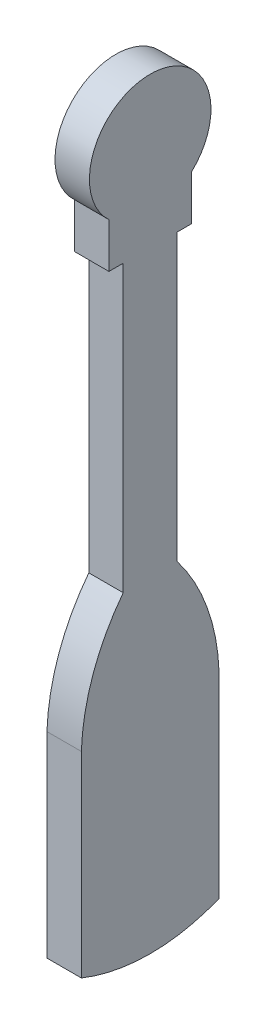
ISO-10303-21;
HEADER;
FILE_DESCRIPTION(('STEP AP214'),'2;1');
FILE_NAME('part.step','',(''),(''),'','','');
FILE_SCHEMA(('AUTOMOTIVE_DESIGN { 1 0 10303 214 1 1 1 1 }'));
ENDSEC;
DATA;
#1=APPLICATION_CONTEXT('core data for automotive mechanical design processes');
#2=APPLICATION_PROTOCOL_DEFINITION('international standard','automotive_design',2000,#1);
#3=PRODUCT_CONTEXT('',#1,'mechanical');
#4=PRODUCT('Part','Part','',(#3));
#5=PRODUCT_RELATED_PRODUCT_CATEGORY('part','',(#4));
#6=PRODUCT_DEFINITION_FORMATION('','',#4);
#7=PRODUCT_DEFINITION_CONTEXT('part definition',#1,'design');
#8=PRODUCT_DEFINITION('design','',#6,#7);
#9=PRODUCT_DEFINITION_SHAPE('','',#8);
#10=(LENGTH_UNIT() NAMED_UNIT(*) SI_UNIT(.MILLI.,.METRE.));
#11=(NAMED_UNIT(*) PLANE_ANGLE_UNIT() SI_UNIT($,.RADIAN.));
#12=(NAMED_UNIT(*) SI_UNIT($,.STERADIAN.) SOLID_ANGLE_UNIT());
#13=UNCERTAINTY_MEASURE_WITH_UNIT(LENGTH_MEASURE(1.E-05),#10,'distance_accuracy_value','');
#14=(GEOMETRIC_REPRESENTATION_CONTEXT(3) GLOBAL_UNCERTAINTY_ASSIGNED_CONTEXT((#13)) GLOBAL_UNIT_ASSIGNED_CONTEXT((#10,
#11,#12)) REPRESENTATION_CONTEXT('',''));
#15=CARTESIAN_POINT('',(0.,0.,0.));
#16=DIRECTION('',(0.,0.,1.));
#17=DIRECTION('',(1.,0.,0.));
#18=AXIS2_PLACEMENT_3D('',#15,#16,#17);
#19=CARTESIAN_POINT('',(15.,4855.89846396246,-12806.2490065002));
#20=DIRECTION('',(-1.,0.,0.));
#21=DIRECTION('',(0.,0.,1.));
#22=AXIS2_PLACEMENT_3D('',#19,#20,#21);
#23=CYLINDRICAL_SURFACE('',#22,26.479842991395);
#24=CARTESIAN_POINT('',(0.,4855.89846396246,-12806.2490065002));
#25=DIRECTION('',(1.,0.,0.));
#26=DIRECTION('',(0.,0.,-1.));
#27=AXIS2_PLACEMENT_3D('',#24,#25,#26);
#28=CIRCLE('',#27,26.479842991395);
#29=CARTESIAN_POINT('',(0.,4836.46374072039,-12824.2343788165));
#30=VERTEX_POINT('',#29);
#31=CARTESIAN_POINT('',(0.,4836.46374072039,-12788.263634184));
#32=VERTEX_POINT('',#31);
#33=EDGE_CURVE('E155',#30,#32,#28,.T.);
#34=ORIENTED_EDGE('',*,*,#33,.T.);
#35=DIRECTION('',(-1.,0.,0.));
#36=VECTOR('',#35,1.);
#37=CARTESIAN_POINT('',(15.,4836.46374072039,-12788.263634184));
#38=LINE('',#37,#36);
#39=CARTESIAN_POINT('',(15.,4836.46374072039,-12788.263634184));
#40=VERTEX_POINT('',#39);
#41=EDGE_CURVE('E11',#40,#32,#38,.T.);
#42=ORIENTED_EDGE('',*,*,#41,.F.);
#43=CARTESIAN_POINT('',(15.,4855.89846396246,-12806.2490065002));
#44=DIRECTION('',(1.,0.,0.));
#45=DIRECTION('',(0.,0.,-1.));
#46=AXIS2_PLACEMENT_3D('',#43,#44,#45);
#47=CIRCLE('',#46,26.479842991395);
#48=CARTESIAN_POINT('',(15.,4836.46374072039,-12824.2343788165));
#49=VERTEX_POINT('',#48);
#50=EDGE_CURVE('E177',#49,#40,#47,.T.);
#51=ORIENTED_EDGE('',*,*,#50,.F.);
#52=DIRECTION('',(-1.,0.,0.));
#53=VECTOR('',#52,1.);
#54=CARTESIAN_POINT('',(15.,4836.46374072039,-12824.2343788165));
#55=LINE('',#54,#53);
#56=EDGE_CURVE('E151',#49,#30,#55,.T.);
#57=ORIENTED_EDGE('',*,*,#56,.T.);
#58=EDGE_LOOP('',(#34,#42,#51,#57));
#59=FACE_BOUND('',#58,.T.);
#60=ADVANCED_FACE('F35',(#59),#23,.T.);
#61=CARTESIAN_POINT('',(15.,4836.46374072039,-12788.263634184));
#62=DIRECTION('',(0.,-2.72355001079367E-13,-1.));
#63=DIRECTION('',(0.,1.,-2.72355001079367E-13));
#64=AXIS2_PLACEMENT_3D('',#61,#62,#63);
#65=PLANE('',#64);
#66=DIRECTION('',(0.,-1.,2.72355001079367E-13));
#67=VECTOR('',#66,1.);
#68=CARTESIAN_POINT('',(0.,4836.46374072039,-12788.263634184));
#69=LINE('',#68,#67);
#70=CARTESIAN_POINT('',(0.,4816.89710710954,-12788.263634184));
#71=VERTEX_POINT('',#70);
#72=EDGE_CURVE('E158',#32,#71,#69,.T.);
#73=ORIENTED_EDGE('',*,*,#72,.T.);
#74=DIRECTION('',(-1.,0.,0.));
#75=VECTOR('',#74,1.);
#76=CARTESIAN_POINT('',(15.,4816.89710710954,-12788.263634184));
#77=LINE('',#76,#75);
#78=CARTESIAN_POINT('',(15.,4816.89710710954,-12788.263634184));
#79=VERTEX_POINT('',#78);
#80=EDGE_CURVE('E43',#79,#71,#77,.T.);
#81=ORIENTED_EDGE('',*,*,#80,.F.);
#82=DIRECTION('',(0.,-1.,2.72355001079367E-13));
#83=VECTOR('',#82,1.);
#84=CARTESIAN_POINT('',(15.,4836.46374072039,-12788.263634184));
#85=LINE('',#84,#83);
#86=EDGE_CURVE('E106',#40,#79,#85,.T.);
#87=ORIENTED_EDGE('',*,*,#86,.F.);
#88=ORIENTED_EDGE('',*,*,#41,.T.);
#89=EDGE_LOOP('',(#73,#81,#87,#88));
#90=FACE_BOUND('',#89,.T.);
#91=ADVANCED_FACE('F255',(#90),#65,.F.);
#92=CARTESIAN_POINT('',(15.,4816.89710710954,-12788.263634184));
#93=DIRECTION('',(0.,1.,0.));
#94=DIRECTION('',(0.,0.,1.));
#95=AXIS2_PLACEMENT_3D('',#92,#93,#94);
#96=PLANE('',#95);
#97=DIRECTION('',(0.,0.,-1.));
#98=VECTOR('',#97,1.);
#99=CARTESIAN_POINT('',(0.,4816.89710710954,-12788.263634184));
#100=LINE('',#99,#98);
#101=CARTESIAN_POINT('',(0.,4816.89710710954,-12794.4817255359));
#102=VERTEX_POINT('',#101);
#103=EDGE_CURVE('E160',#71,#102,#100,.T.);
#104=ORIENTED_EDGE('',*,*,#103,.T.);
#105=DIRECTION('',(-1.,0.,0.));
#106=VECTOR('',#105,1.);
#107=CARTESIAN_POINT('',(15.,4816.89710710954,-12794.4817255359));
#108=LINE('',#107,#106);
#109=CARTESIAN_POINT('',(15.,4816.89710710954,-12794.4817255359));
#110=VERTEX_POINT('',#109);
#111=EDGE_CURVE('E196',#110,#102,#108,.T.);
#112=ORIENTED_EDGE('',*,*,#111,.F.);
#113=DIRECTION('',(0.,0.,-1.));
#114=VECTOR('',#113,1.);
#115=CARTESIAN_POINT('',(15.,4816.89710710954,-12788.263634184));
#116=LINE('',#115,#114);
#117=EDGE_CURVE('E204',#79,#110,#116,.T.);
#118=ORIENTED_EDGE('',*,*,#117,.F.);
#119=ORIENTED_EDGE('',*,*,#80,.T.);
#120=EDGE_LOOP('',(#104,#112,#118,#119));
#121=FACE_BOUND('',#120,.T.);
#122=ADVANCED_FACE('F202',(#121),#96,.F.);
#123=CARTESIAN_POINT('',(15.,4816.89710710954,-12794.4817255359));
#124=DIRECTION('',(0.,0.,-1.));
#125=DIRECTION('',(-1.,0.,0.));
#126=AXIS2_PLACEMENT_3D('',#123,#124,#125);
#127=PLANE('',#126);
#128=DIRECTION('',(0.,-1.,0.));
#129=VECTOR('',#128,1.);
#130=CARTESIAN_POINT('',(0.,4816.89710710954,-12794.4817255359));
#131=LINE('',#130,#129);
#132=CARTESIAN_POINT('',(0.,4692.5329775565,-12794.4817255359));
#133=VERTEX_POINT('',#132);
#134=EDGE_CURVE('E162',#102,#133,#131,.T.);
#135=ORIENTED_EDGE('',*,*,#134,.T.);
#136=DIRECTION('',(-1.,0.,0.));
#137=VECTOR('',#136,1.);
#138=CARTESIAN_POINT('',(15.,4692.5329775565,-12794.4817255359));
#139=LINE('',#138,#137);
#140=CARTESIAN_POINT('',(15.,4692.5329775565,-12794.4817255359));
#141=VERTEX_POINT('',#140);
#142=EDGE_CURVE('E193',#141,#133,#139,.T.);
#143=ORIENTED_EDGE('',*,*,#142,.F.);
#144=DIRECTION('',(0.,-1.,0.));
#145=VECTOR('',#144,1.);
#146=CARTESIAN_POINT('',(15.,4816.89710710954,-12794.4817255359));
#147=LINE('',#146,#145);
#148=EDGE_CURVE('E222',#110,#141,#147,.T.);
#149=ORIENTED_EDGE('',*,*,#148,.F.);
#150=ORIENTED_EDGE('',*,*,#111,.T.);
#151=EDGE_LOOP('',(#135,#143,#149,#150));
#152=FACE_BOUND('',#151,.T.);
#153=ADVANCED_FACE('F213',(#152),#127,.F.);
#154=CARTESIAN_POINT('',(15.,4638.68592470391,-12864.6206511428));
#155=DIRECTION('',(-1.,0.,0.));
#156=DIRECTION('',(0.,0.,1.));
#157=AXIS2_PLACEMENT_3D('',#154,#155,#156);
#158=CYLINDRICAL_SURFACE('',#157,88.4249624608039);
#159=CARTESIAN_POINT('',(0.,4638.68592470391,-12864.6206511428));
#160=DIRECTION('',(1.,0.,0.));
#161=DIRECTION('',(0.,0.,-1.));
#162=AXIS2_PLACEMENT_3D('',#159,#160,#161);
#163=CIRCLE('',#162,88.4249624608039);
#164=CARTESIAN_POINT('',(0.,4641.75617051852,-12776.2490065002));
#165=VERTEX_POINT('',#164);
#166=EDGE_CURVE('E164',#133,#165,#163,.T.);
#167=ORIENTED_EDGE('',*,*,#166,.T.);
#168=DIRECTION('',(-1.,0.,0.));
#169=VECTOR('',#168,1.);
#170=CARTESIAN_POINT('',(15.,4641.75617051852,-12776.2490065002));
#171=LINE('',#170,#169);
#172=CARTESIAN_POINT('',(15.,4641.75617051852,-12776.2490065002));
#173=VERTEX_POINT('',#172);
#174=EDGE_CURVE('E190',#173,#165,#171,.T.);
#175=ORIENTED_EDGE('',*,*,#174,.F.);
#176=CARTESIAN_POINT('',(15.,4638.68592470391,-12864.6206511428));
#177=DIRECTION('',(1.,0.,0.));
#178=DIRECTION('',(0.,0.,-1.));
#179=AXIS2_PLACEMENT_3D('',#176,#177,#178);
#180=CIRCLE('',#179,88.4249624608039);
#181=EDGE_CURVE('E219',#141,#173,#180,.T.);
#182=ORIENTED_EDGE('',*,*,#181,.F.);
#183=ORIENTED_EDGE('',*,*,#142,.T.);
#184=EDGE_LOOP('',(#167,#175,#182,#183));
#185=FACE_BOUND('',#184,.T.);
#186=ADVANCED_FACE('F217',(#185),#158,.T.);
#187=CARTESIAN_POINT('',(15.,4641.75617051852,-12776.2490065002));
#188=DIRECTION('',(0.,0.,-1.));
#189=DIRECTION('',(-1.,0.,0.));
#190=AXIS2_PLACEMENT_3D('',#187,#188,#189);
#191=PLANE('',#190);
#192=DIRECTION('',(0.,-1.,0.));
#193=VECTOR('',#192,1.);
#194=CARTESIAN_POINT('',(0.,4641.75617051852,-12776.2490065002));
#195=LINE('',#194,#193);
#196=CARTESIAN_POINT('',(0.,4556.25091772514,-12776.2490065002));
#197=VERTEX_POINT('',#196);
#198=EDGE_CURVE('E166',#165,#197,#195,.T.);
#199=ORIENTED_EDGE('',*,*,#198,.T.);
#200=DIRECTION('',(-1.,0.,0.));
#201=VECTOR('',#200,1.);
#202=CARTESIAN_POINT('',(15.,4556.25091772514,-12776.2490065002));
#203=LINE('',#202,#201);
#204=CARTESIAN_POINT('',(15.,4556.25091772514,-12776.2490065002));
#205=VERTEX_POINT('',#204);
#206=EDGE_CURVE('E187',#205,#197,#203,.T.);
#207=ORIENTED_EDGE('',*,*,#206,.F.);
#208=DIRECTION('',(0.,-1.,0.));
#209=VECTOR('',#208,1.);
#210=CARTESIAN_POINT('',(15.,4641.75617051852,-12776.2490065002));
#211=LINE('',#210,#209);
#212=EDGE_CURVE('E221',#173,#205,#211,.T.);
#213=ORIENTED_EDGE('',*,*,#212,.F.);
#214=ORIENTED_EDGE('',*,*,#174,.T.);
#215=EDGE_LOOP('',(#199,#207,#213,#214));
#216=FACE_BOUND('',#215,.T.);
#217=ADVANCED_FACE('F268',(#216),#191,.F.);
#218=CARTESIAN_POINT('',(15.,4630.25410640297,-12806.2490065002));
#219=DIRECTION('',(-1.,0.,0.));
#220=DIRECTION('',(0.,0.,1.));
#221=AXIS2_PLACEMENT_3D('',#218,#219,#220);
#222=CYLINDRICAL_SURFACE('',#221,79.8528141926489);
#223=CARTESIAN_POINT('',(0.,4630.25410640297,-12806.2490065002));
#224=DIRECTION('',(1.,0.,0.));
#225=DIRECTION('',(0.,0.,-1.));
#226=AXIS2_PLACEMENT_3D('',#223,#224,#225);
#227=CIRCLE('',#226,79.8528141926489);
#228=CARTESIAN_POINT('',(0.,4556.25091772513,-12836.2490065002));
#229=VERTEX_POINT('',#228);
#230=EDGE_CURVE('E168',#197,#229,#227,.T.);
#231=ORIENTED_EDGE('',*,*,#230,.T.);
#232=DIRECTION('',(-1.,0.,0.));
#233=VECTOR('',#232,1.);
#234=CARTESIAN_POINT('',(15.,4556.25091772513,-12836.2490065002));
#235=LINE('',#234,#233);
#236=CARTESIAN_POINT('',(15.,4556.25091772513,-12836.2490065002));
#237=VERTEX_POINT('',#236);
#238=EDGE_CURVE('E184',#237,#229,#235,.T.);
#239=ORIENTED_EDGE('',*,*,#238,.F.);
#240=CARTESIAN_POINT('',(15.,4630.25410640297,-12806.2490065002));
#241=DIRECTION('',(1.,0.,0.));
#242=DIRECTION('',(0.,0.,-1.));
#243=AXIS2_PLACEMENT_3D('',#240,#241,#242);
#244=CIRCLE('',#243,79.8528141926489);
#245=EDGE_CURVE('E224',#205,#237,#244,.T.);
#246=ORIENTED_EDGE('',*,*,#245,.F.);
#247=ORIENTED_EDGE('',*,*,#206,.T.);
#248=EDGE_LOOP('',(#231,#239,#246,#247));
#249=FACE_BOUND('',#248,.T.);
#250=ADVANCED_FACE('F271',(#249),#222,.T.);
#251=CARTESIAN_POINT('',(15.,4641.75617051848,-12836.2490065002));
#252=DIRECTION('',(0.,1.45423789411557E-13,1.));
#253=DIRECTION('',(0.,-1.,1.45423789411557E-13));
#254=AXIS2_PLACEMENT_3D('',#251,#252,#253);
#255=PLANE('',#254);
#256=DIRECTION('',(0.,1.,-1.45423789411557E-13));
#257=VECTOR('',#256,1.);
#258=CARTESIAN_POINT('',(0.,4641.75617051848,-12836.2490065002));
#259=LINE('',#258,#257);
#260=CARTESIAN_POINT('',(0.,4641.75617051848,-12836.2490065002));
#261=VERTEX_POINT('',#260);
#262=EDGE_CURVE('E170',#229,#261,#259,.T.);
#263=ORIENTED_EDGE('',*,*,#262,.T.);
#264=DIRECTION('',(-1.,0.,0.));
#265=VECTOR('',#264,1.);
#266=CARTESIAN_POINT('',(15.,4641.75617051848,-12836.2490065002));
#267=LINE('',#266,#265);
#268=CARTESIAN_POINT('',(15.,4641.75617051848,-12836.2490065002));
#269=VERTEX_POINT('',#268);
#270=EDGE_CURVE('E181',#269,#261,#267,.T.);
#271=ORIENTED_EDGE('',*,*,#270,.F.);
#272=DIRECTION('',(0.,1.,-1.45423789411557E-13));
#273=VECTOR('',#272,1.);
#274=CARTESIAN_POINT('',(15.,4641.75617051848,-12836.2490065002));
#275=LINE('',#274,#273);
#276=EDGE_CURVE('E230',#237,#269,#275,.T.);
#277=ORIENTED_EDGE('',*,*,#276,.F.);
#278=ORIENTED_EDGE('',*,*,#238,.T.);
#279=EDGE_LOOP('',(#263,#271,#277,#278));
#280=FACE_BOUND('',#279,.T.);
#281=ADVANCED_FACE('F236',(#280),#255,.F.);
#282=CARTESIAN_POINT('',(15.,4638.68592470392,-12747.8773618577));
#283=DIRECTION('',(-1.,0.,0.));
#284=DIRECTION('',(0.,0.,1.));
#285=AXIS2_PLACEMENT_3D('',#282,#283,#284);
#286=CYLINDRICAL_SURFACE('',#285,88.4249624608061);
#287=CARTESIAN_POINT('',(0.,4638.68592470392,-12747.8773618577));
#288=DIRECTION('',(1.,0.,0.));
#289=DIRECTION('',(0.,0.,-1.));
#290=AXIS2_PLACEMENT_3D('',#287,#288,#289);
#291=CIRCLE('',#290,88.4249624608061);
#292=CARTESIAN_POINT('',(0.,4692.53297755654,-12818.0162874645));
#293=VERTEX_POINT('',#292);
#294=EDGE_CURVE('E172',#261,#293,#291,.T.);
#295=ORIENTED_EDGE('',*,*,#294,.T.);
#296=DIRECTION('',(-1.,0.,0.));
#297=VECTOR('',#296,1.);
#298=CARTESIAN_POINT('',(15.,4692.53297755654,-12818.0162874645));
#299=LINE('',#298,#297);
#300=CARTESIAN_POINT('',(15.,4692.53297755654,-12818.0162874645));
#301=VERTEX_POINT('',#300);
#302=EDGE_CURVE('E146',#301,#293,#299,.T.);
#303=ORIENTED_EDGE('',*,*,#302,.F.);
#304=CARTESIAN_POINT('',(15.,4638.68592470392,-12747.8773618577));
#305=DIRECTION('',(1.,0.,0.));
#306=DIRECTION('',(0.,0.,-1.));
#307=AXIS2_PLACEMENT_3D('',#304,#305,#306);
#308=CIRCLE('',#307,88.4249624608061);
#309=EDGE_CURVE('E137',#269,#301,#308,.T.);
#310=ORIENTED_EDGE('',*,*,#309,.F.);
#311=ORIENTED_EDGE('',*,*,#270,.T.);
#312=EDGE_LOOP('',(#295,#303,#310,#311));
#313=FACE_BOUND('',#312,.T.);
#314=ADVANCED_FACE('F240',(#313),#286,.T.);
#315=CARTESIAN_POINT('',(15.,4816.89710710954,-12818.0162874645));
#316=DIRECTION('',(0.,2.71386774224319E-13,1.));
#317=DIRECTION('',(0.,-1.,2.71386774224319E-13));
#318=AXIS2_PLACEMENT_3D('',#315,#316,#317);
#319=PLANE('',#318);
#320=DIRECTION('',(0.,1.,-2.71386774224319E-13));
#321=VECTOR('',#320,1.);
#322=CARTESIAN_POINT('',(0.,4816.89710710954,-12818.0162874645));
#323=LINE('',#322,#321);
#324=CARTESIAN_POINT('',(0.,4816.89710710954,-12818.0162874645));
#325=VERTEX_POINT('',#324);
#326=EDGE_CURVE('E145',#293,#325,#323,.T.);
#327=ORIENTED_EDGE('',*,*,#326,.T.);
#328=DIRECTION('',(-1.,0.,0.));
#329=VECTOR('',#328,1.);
#330=CARTESIAN_POINT('',(15.,4816.89710710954,-12818.0162874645));
#331=LINE('',#330,#329);
#332=CARTESIAN_POINT('',(15.,4816.89710710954,-12818.0162874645));
#333=VERTEX_POINT('',#332);
#334=EDGE_CURVE('E142',#333,#325,#331,.T.);
#335=ORIENTED_EDGE('',*,*,#334,.F.);
#336=DIRECTION('',(0.,1.,-2.71386774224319E-13));
#337=VECTOR('',#336,1.);
#338=CARTESIAN_POINT('',(15.,4816.89710710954,-12818.0162874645));
#339=LINE('',#338,#337);
#340=EDGE_CURVE('E131',#301,#333,#339,.T.);
#341=ORIENTED_EDGE('',*,*,#340,.F.);
#342=ORIENTED_EDGE('',*,*,#302,.T.);
#343=EDGE_LOOP('',(#327,#335,#341,#342));
#344=FACE_BOUND('',#343,.T.);
#345=ADVANCED_FACE('F143',(#344),#319,.F.);
#346=CARTESIAN_POINT('',(15.,4816.89710710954,-12824.2343788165));
#347=DIRECTION('',(0.,1.,0.));
#348=DIRECTION('',(0.,0.,1.));
#349=AXIS2_PLACEMENT_3D('',#346,#347,#348);
#350=PLANE('',#349);
#351=DIRECTION('',(0.,0.,-1.));
#352=VECTOR('',#351,1.);
#353=CARTESIAN_POINT('',(0.,4816.89710710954,-12824.2343788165));
#354=LINE('',#353,#352);
#355=CARTESIAN_POINT('',(0.,4816.89710710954,-12824.2343788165));
#356=VERTEX_POINT('',#355);
#357=EDGE_CURVE('E92',#325,#356,#354,.T.);
#358=ORIENTED_EDGE('',*,*,#357,.T.);
#359=DIRECTION('',(-1.,0.,0.));
#360=VECTOR('',#359,1.);
#361=CARTESIAN_POINT('',(15.,4816.89710710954,-12824.2343788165));
#362=LINE('',#361,#360);
#363=CARTESIAN_POINT('',(15.,4816.89710710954,-12824.2343788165));
#364=VERTEX_POINT('',#363);
#365=EDGE_CURVE('E147',#364,#356,#362,.T.);
#366=ORIENTED_EDGE('',*,*,#365,.F.);
#367=DIRECTION('',(0.,0.,-1.));
#368=VECTOR('',#367,1.);
#369=CARTESIAN_POINT('',(15.,4816.89710710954,-12824.2343788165));
#370=LINE('',#369,#368);
#371=EDGE_CURVE('E135',#333,#364,#370,.T.);
#372=ORIENTED_EDGE('',*,*,#371,.F.);
#373=ORIENTED_EDGE('',*,*,#334,.T.);
#374=EDGE_LOOP('',(#358,#366,#372,#373));
#375=FACE_BOUND('',#374,.T.);
#376=ADVANCED_FACE('F149',(#375),#350,.F.);
#377=CARTESIAN_POINT('',(15.,4836.46374072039,-12824.2343788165));
#378=DIRECTION('',(0.,-3.63140001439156E-13,1.));
#379=DIRECTION('',(0.,-1.,-3.63140001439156E-13));
#380=AXIS2_PLACEMENT_3D('',#377,#378,#379);
#381=PLANE('',#380);
#382=DIRECTION('',(0.,1.,3.63140001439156E-13));
#383=VECTOR('',#382,1.);
#384=CARTESIAN_POINT('',(0.,4836.46374072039,-12824.2343788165));
#385=LINE('',#384,#383);
#386=EDGE_CURVE('E98',#356,#30,#385,.T.);
#387=ORIENTED_EDGE('',*,*,#386,.T.);
#388=ORIENTED_EDGE('',*,*,#56,.F.);
#389=DIRECTION('',(0.,1.,3.63140001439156E-13));
#390=VECTOR('',#389,1.);
#391=CARTESIAN_POINT('',(15.,4836.46374072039,-12824.2343788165));
#392=LINE('',#391,#390);
#393=EDGE_CURVE('E51',#364,#49,#392,.T.);
#394=ORIENTED_EDGE('',*,*,#393,.F.);
#395=ORIENTED_EDGE('',*,*,#365,.T.);
#396=EDGE_LOOP('',(#387,#388,#394,#395));
#397=FACE_BOUND('',#396,.T.);
#398=ADVANCED_FACE('F244',(#397),#381,.F.);
#399=CARTESIAN_POINT('',(15.,4855.89846396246,-12806.2490065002));
#400=DIRECTION('',(1.,0.,0.));
#401=DIRECTION('',(0.,0.,-1.));
#402=AXIS2_PLACEMENT_3D('',#399,#400,#401);
#403=PLANE('',#402);
#404=ORIENTED_EDGE('',*,*,#50,.T.);
#405=ORIENTED_EDGE('',*,*,#86,.T.);
#406=ORIENTED_EDGE('',*,*,#117,.T.);
#407=ORIENTED_EDGE('',*,*,#148,.T.);
#408=ORIENTED_EDGE('',*,*,#181,.T.);
#409=ORIENTED_EDGE('',*,*,#212,.T.);
#410=ORIENTED_EDGE('',*,*,#245,.T.);
#411=ORIENTED_EDGE('',*,*,#276,.T.);
#412=ORIENTED_EDGE('',*,*,#309,.T.);
#413=ORIENTED_EDGE('',*,*,#340,.T.);
#414=ORIENTED_EDGE('',*,*,#371,.T.);
#415=ORIENTED_EDGE('',*,*,#393,.T.);
#416=EDGE_LOOP('',(#404,#405,#406,#407,#408,#409,#410,#411,#412,#413,#414,#415));
#417=FACE_BOUND('',#416,.T.);
#418=ADVANCED_FACE('F133',(#417),#403,.T.);
#419=CARTESIAN_POINT('',(0.,4855.89846396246,-12806.2490065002));
#420=DIRECTION('',(1.,0.,0.));
#421=DIRECTION('',(0.,0.,-1.));
#422=AXIS2_PLACEMENT_3D('',#419,#420,#421);
#423=PLANE('',#422);
#424=ORIENTED_EDGE('',*,*,#33,.F.);
#425=ORIENTED_EDGE('',*,*,#386,.F.);
#426=ORIENTED_EDGE('',*,*,#357,.F.);
#427=ORIENTED_EDGE('',*,*,#326,.F.);
#428=ORIENTED_EDGE('',*,*,#294,.F.);
#429=ORIENTED_EDGE('',*,*,#262,.F.);
#430=ORIENTED_EDGE('',*,*,#230,.F.);
#431=ORIENTED_EDGE('',*,*,#198,.F.);
#432=ORIENTED_EDGE('',*,*,#166,.F.);
#433=ORIENTED_EDGE('',*,*,#134,.F.);
#434=ORIENTED_EDGE('',*,*,#103,.F.);
#435=ORIENTED_EDGE('',*,*,#72,.F.);
#436=EDGE_LOOP('',(#424,#425,#426,#427,#428,#429,#430,#431,#432,#433,#434,#435));
#437=FACE_BOUND('',#436,.T.);
#438=ADVANCED_FACE('F208',(#437),#423,.F.);
#439=CLOSED_SHELL('',(#60,#91,#122,#153,#186,#217,#250,#281,#314,#345,#376,#398,#418,#438));
#440=MANIFOLD_SOLID_BREP('B2',#439);
#441=ADVANCED_BREP_SHAPE_REPRESENTATION('',(#18,#440),#14);
#442=SHAPE_DEFINITION_REPRESENTATION(#9,#441);
ENDSEC;
END-ISO-10303-21;
